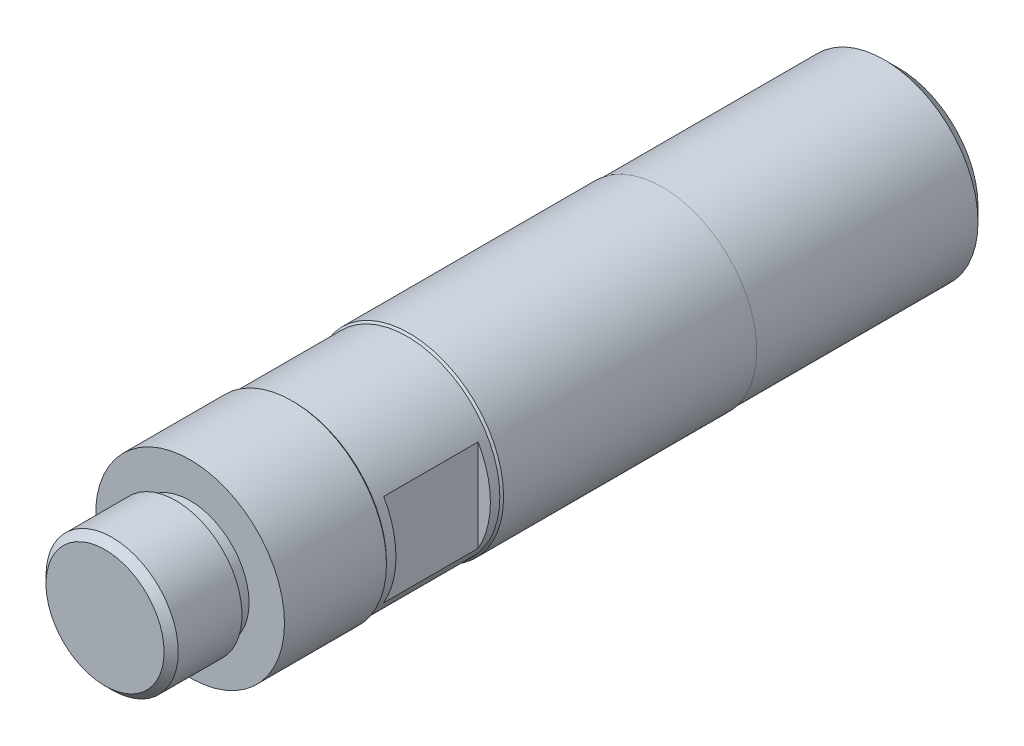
from build123d import *

# Parameters (mm, degrees)
ESQUISSE1_R             = 10
BASE_EXTRUSION_DEPTH    = 75
ESQUISSE2_R             = 7
BOSS_EXTRU_1_DEPTH      = 9
CHANFREIN1_SIZE         = 0.75
ESQUISSE3_W             = 1.5
ESQUISSE3_H             = 10
ENL_V_MAT_EXTRU_1_DEPTH = 19.5
ESQUISSE4_W             = 3.75
ESQUISSE4_H             = 1.5
ESQUISSE6_W             = 25
ESQUISSE6_H             = 0.075
CHANFREIN2_SIZE         = 1.5


with BuildPart() as part:
    # Esquisse1 → Base-Extrusion (new body)
    with BuildSketch(Plane.XY):
        Circle(ESQUISSE1_R)
    extrude(amount=BASE_EXTRUSION_DEPTH)

    # Esquisse2 → Boss.-Extru.1 (add)
    with BuildSketch(Plane.XY.offset(75)):
        Circle(ESQUISSE2_R)
    extrude(amount=BOSS_EXTRU_1_DEPTH)

    # Chanfrein1
    chanfrein1_edges = [part.edges().sort_by_distance(p)[0] for p in [
        (-7, 0, 84),
    ]]
    chamfer(chanfrein1_edges, length=CHANFREIN1_SIZE)

    # Esquisse3 → Enl_v. mat.-Extru.1 (cut, symmetric)
    with BuildSketch(Plane(origin=(0, 0, 0), x_dir=(1, 0, 0), z_dir=(0, 1, 0))):
        with Locations((-9.25, -58)):
            Rectangle(ESQUISSE3_W, ESQUISSE3_H)
        with Locations((9.25, -58)):
            Rectangle(ESQUISSE3_W, ESQUISSE3_H)
    extrude(amount=ENL_V_MAT_EXTRU_1_DEPTH, both=True, mode=Mode.SUBTRACT)

    # Esquisse4 → Enl_vement de mati_re-R_volution1 (revolve, cut)
    with BuildSketch(Plane(origin=(0, 0, 0), x_dir=(1, 0, 0), z_dir=(0, 1, 0))):
        with Locations((-8.125, -75.75)):
            Rectangle(ESQUISSE4_W, ESQUISSE4_H)
    revolve(axis=Axis((0, 0, 83.908211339), (0, 0, -1)), mode=Mode.SUBTRACT)

    # Esquisse5 → Enl_vement de mati_re-R_volution2 (revolve, cut)
    with BuildSketch(Plane(origin=(0, 0, 0), x_dir=(0, 0, -1), z_dir=(1, 0, 0)), mode=Mode.PRIVATE) as enl_vement_de_mati_re_r_volution2_sk:
        Polygon((-64.2, 10), (-64, 9.8), (-52, 9.8), (-51.8, 10), align=None)
    revolve(enl_vement_de_mati_re_r_volution2_sk.sketch.rotate(Axis((0, 0, 84), (0, 0, -1)), 90), axis=Axis((0, 0, 84), (0, 0, -1)), mode=Mode.SUBTRACT)

    # Esquisse6 → Enl_vement de mati_re-R_volution3 (revolve, cut)
    with BuildSketch(Plane(origin=(0, 0, 0), x_dir=(0, 0, -1), z_dir=(1, 0, 0)), mode=Mode.PRIVATE) as enl_vement_de_mati_re_r_volution3_sk:
        with Locations((-12.5, 9.9625)):
            Rectangle(ESQUISSE6_W, ESQUISSE6_H)
    revolve(enl_vement_de_mati_re_r_volution3_sk.sketch.rotate(Axis((0, 0, 84), (0, 0, -1)), 90), axis=Axis((0, 0, 84), (0, 0, -1)), mode=Mode.SUBTRACT)

    # Chanfrein2
    chanfrein2_edges = [part.edges().sort_by_distance(p)[0] for p in [
        (-9.925, 0, 0),
    ]]
    chamfer(chanfrein2_edges, length=CHANFREIN2_SIZE)


solid = part.part
